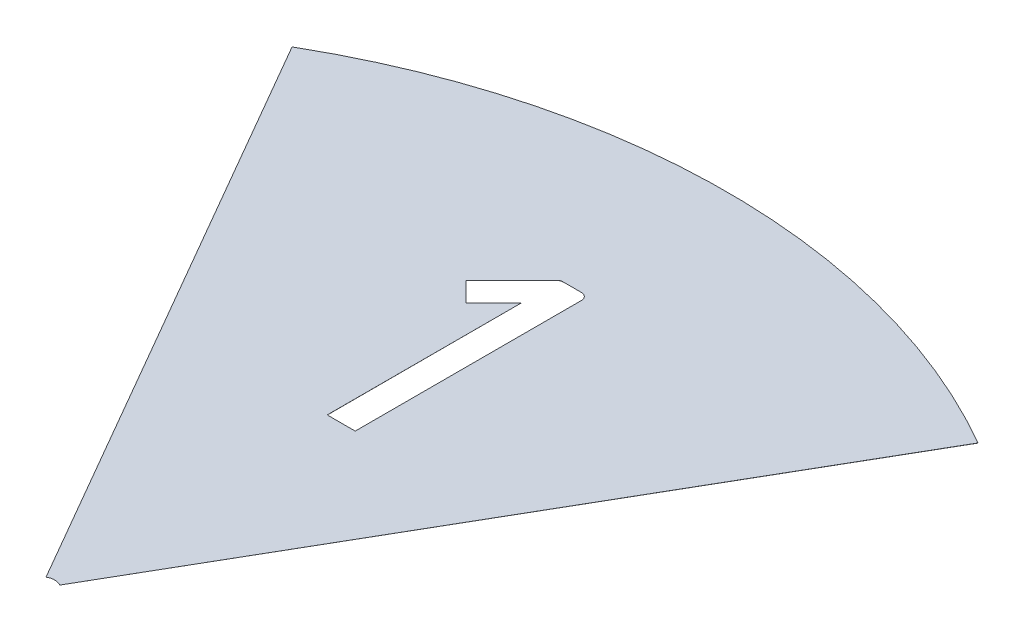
ISO-10303-21;
HEADER;
FILE_DESCRIPTION(('STEP AP214'),'2;1');
FILE_NAME('part.step','',(''),(''),'','','');
FILE_SCHEMA(('AUTOMOTIVE_DESIGN { 1 0 10303 214 1 1 1 1 }'));
ENDSEC;
DATA;
#1=APPLICATION_CONTEXT('core data for automotive mechanical design processes');
#2=APPLICATION_PROTOCOL_DEFINITION('international standard','automotive_design',2000,#1);
#3=PRODUCT_CONTEXT('',#1,'mechanical');
#4=PRODUCT('Part','Part','',(#3));
#5=PRODUCT_RELATED_PRODUCT_CATEGORY('part','',(#4));
#6=PRODUCT_DEFINITION_FORMATION('','',#4);
#7=PRODUCT_DEFINITION_CONTEXT('part definition',#1,'design');
#8=PRODUCT_DEFINITION('design','',#6,#7);
#9=PRODUCT_DEFINITION_SHAPE('','',#8);
#10=(LENGTH_UNIT() NAMED_UNIT(*) SI_UNIT(.MILLI.,.METRE.));
#11=(NAMED_UNIT(*) PLANE_ANGLE_UNIT() SI_UNIT($,.RADIAN.));
#12=(NAMED_UNIT(*) SI_UNIT($,.STERADIAN.) SOLID_ANGLE_UNIT());
#13=UNCERTAINTY_MEASURE_WITH_UNIT(LENGTH_MEASURE(1.E-05),#10,'distance_accuracy_value','');
#14=(GEOMETRIC_REPRESENTATION_CONTEXT(3) GLOBAL_UNCERTAINTY_ASSIGNED_CONTEXT((#13)) GLOBAL_UNIT_ASSIGNED_CONTEXT((#10,
#11,#12)) REPRESENTATION_CONTEXT('',''));
#15=CARTESIAN_POINT('',(0.,0.,0.));
#16=DIRECTION('',(0.,0.,1.));
#17=DIRECTION('',(1.,0.,0.));
#18=AXIS2_PLACEMENT_3D('',#15,#16,#17);
#19=CARTESIAN_POINT('',(-9.51086228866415,-12.7492245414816,13.6871812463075));
#20=DIRECTION('',(0.,1.,0.));
#21=DIRECTION('',(0.,0.,1.));
#22=AXIS2_PLACEMENT_3D('',#19,#20,#21);
#23=PLANE('',#22);
#24=CARTESIAN_POINT('',(-13.4418089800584,-12.7592245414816,-21.2211022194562));
#25=DIRECTION('',(0.707106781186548,0.,0.707106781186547));
#26=VECTOR('',#25,1.);
#27=LINE('',#24,#26);
#28=CARTESIAN_POINT('',(-13.4418088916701,-12.7542245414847,-21.2211023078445));
#29=VERTEX_POINT('',#28);
#30=CARTESIAN_POINT('',(-11.9993112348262,-12.7542245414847,-19.7786044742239));
#31=VERTEX_POINT('',#30);
#32=EDGE_CURVE('E84',#29,#31,#27,.T.);
#33=ORIENTED_EDGE('',*,*,#32,.F.);
#34=CARTESIAN_POINT('',(-10.1472209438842,-12.7592245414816,-24.5156902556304));
#35=DIRECTION('',(-0.707106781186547,0.,0.707106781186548));
#36=VECTOR('',#35,1.);
#37=LINE('',#34,#36);
#38=CARTESIAN_POINT('',(-10.1472209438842,-12.7542245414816,-24.5156902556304));
#39=VERTEX_POINT('',#38);
#40=EDGE_CURVE('E88',#39,#29,#37,.T.);
#41=ORIENTED_EDGE('',*,*,#40,.F.);
#42=CARTESIAN_POINT('',(-9.78659648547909,-12.7492245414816,-24.6650657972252));
#43=CARTESIAN_POINT('',(-9.85412872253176,-12.7492245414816,-24.6581030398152));
#44=CARTESIAN_POINT('',(-9.9891931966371,-12.7492245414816,-24.6441775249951));
#45=CARTESIAN_POINT('',(-10.0945450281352,-12.7492245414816,-24.5585193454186));
#46=CARTESIAN_POINT('',(-10.1472209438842,-12.7492245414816,-24.5156902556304));
#47=B_SPLINE_CURVE_WITH_KNOTS('',3,(#42,#43,#44,#45,#46),.UNSPECIFIED.,.F.,.F.,(4,1,4),(0.,
0.499999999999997,1.),.UNSPECIFIED.);
#48=CARTESIAN_POINT('',(-9.78659615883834,-12.7542245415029,-24.6650657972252));
#49=VERTEX_POINT('',#48);
#50=EDGE_CURVE('E297',#49,#39,#47,.T.);
#51=ORIENTED_EDGE('',*,*,#50,.F.);
#52=CARTESIAN_POINT('',(-8.46784540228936,-12.7592245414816,-24.6650657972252));
#53=DIRECTION('',(-1.,0.,0.));
#54=VECTOR('',#53,1.);
#55=LINE('',#52,#54);
#56=CARTESIAN_POINT('',(-8.46784540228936,-12.7542245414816,-24.6650657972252));
#57=VERTEX_POINT('',#56);
#58=EDGE_CURVE('E146',#57,#49,#55,.T.);
#59=ORIENTED_EDGE('',*,*,#58,.F.);
#60=CARTESIAN_POINT('',(-8.46784540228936,-12.7492245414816,-24.1550657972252));
#61=DIRECTION('',(0.,1.,0.));
#62=DIRECTION('',(0.,0.,1.));
#63=AXIS2_PLACEMENT_3D('',#60,#61,#62);
#64=CIRCLE('',#63,0.510000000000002);
#65=CARTESIAN_POINT('',(-7.95784540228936,-12.7492245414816,-24.1550657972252));
#66=VERTEX_POINT('',#65);
#67=EDGE_CURVE('E224',#66,#57,#64,.T.);
#68=ORIENTED_EDGE('',*,*,#67,.F.);
#69=DIRECTION('',(0.,0.,-1.));
#70=VECTOR('',#69,1.);
#71=CARTESIAN_POINT('',(-7.95784540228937,-12.7492245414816,-7.66506579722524));
#72=LINE('',#71,#70);
#73=CARTESIAN_POINT('',(-7.95784540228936,-12.7492245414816,-7.66506579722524));
#74=VERTEX_POINT('',#73);
#75=EDGE_CURVE('E278',#74,#66,#72,.T.);
#76=ORIENTED_EDGE('',*,*,#75,.F.);
#77=DIRECTION('',(1.,0.,0.));
#78=VECTOR('',#77,1.);
#79=CARTESIAN_POINT('',(-9.99784540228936,-12.7492245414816,-7.66506579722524));
#80=LINE('',#79,#78);
#81=CARTESIAN_POINT('',(-9.99784540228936,-12.7492245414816,-7.66506579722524));
#82=VERTEX_POINT('',#81);
#83=EDGE_CURVE('E287',#82,#74,#80,.T.);
#84=ORIENTED_EDGE('',*,*,#83,.F.);
#85=DIRECTION('',(0.,0.,1.));
#86=VECTOR('',#85,1.);
#87=CARTESIAN_POINT('',(-9.99784540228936,-12.7492245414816,-21.7800701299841));
#88=LINE('',#87,#86);
#89=CARTESIAN_POINT('',(-9.99784552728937,-12.7542245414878,-21.7800700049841));
#90=VERTEX_POINT('',#89);
#91=EDGE_CURVE('E281',#90,#82,#88,.T.);
#92=ORIENTED_EDGE('',*,*,#91,.F.);
#93=CARTESIAN_POINT('',(-11.9993111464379,-12.7592245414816,-19.7786043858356));
#94=DIRECTION('',(0.707106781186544,0.,-0.707106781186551));
#95=VECTOR('',#94,1.);
#96=LINE('',#93,#95);
#97=EDGE_CURVE('E91',#31,#90,#96,.T.);
#98=ORIENTED_EDGE('',*,*,#97,.F.);
#99=EDGE_LOOP('',(#33,#41,#51,#59,#68,#76,#84,#92,#98));
#100=FACE_BOUND('',#99,.T.);
#101=CARTESIAN_POINT('',(-10.0108622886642,-12.7492245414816,12.8211558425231));
#102=CARTESIAN_POINT('',(-9.77586407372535,-12.7492245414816,12.6863717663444));
#103=CARTESIAN_POINT('',(-9.51086228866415,-12.7492245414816,12.6871812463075));
#104=CARTESIAN_POINT('',(-9.24302270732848,-12.7492245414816,12.6879993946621));
#105=CARTESIAN_POINT('',(-9.01086228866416,-12.7492245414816,12.8211558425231));
#106=B_SPLINE_CURVE_WITH_KNOTS('',2,(#101,#102,#103,#104,#105),.UNSPECIFIED.,.F.,.F.,(3,2,3),
(0.,0.5,1.),.UNSPECIFIED.);
#107=CARTESIAN_POINT('',(-10.0108622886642,-12.7542245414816,12.8211558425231));
#108=VERTEX_POINT('',#107);
#109=CARTESIAN_POINT('',(-9.01086228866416,-12.7542245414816,12.8211558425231));
#110=VERTEX_POINT('',#109);
#111=EDGE_CURVE('E26',#108,#110,#106,.T.);
#112=ORIENTED_EDGE('',*,*,#111,.T.);
#113=DIRECTION('',(0.499999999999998,0.,-0.86602540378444));
#114=VECTOR('',#113,1.);
#115=CARTESIAN_POINT('',(-9.01086228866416,-12.7492245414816,12.8211558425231));
#116=LINE('',#115,#114);
#117=CARTESIAN_POINT('',(15.4891377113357,-12.7492245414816,-29.6140889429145));
#118=VERTEX_POINT('',#117);
#119=EDGE_CURVE('E103',#110,#118,#116,.T.);
#120=ORIENTED_EDGE('',*,*,#119,.T.);
#121=CARTESIAN_POINT('',(-9.51086228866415,-12.7492245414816,13.6871812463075));
#122=DIRECTION('',(0.,1.,0.));
#123=DIRECTION('',(0.,0.,1.));
#124=AXIS2_PLACEMENT_3D('',#121,#122,#123);
#125=CIRCLE('',#124,50.);
#126=CARTESIAN_POINT('',(-34.510862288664,-12.7492245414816,-29.6140889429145));
#127=VERTEX_POINT('',#126);
#128=EDGE_CURVE('E219',#118,#127,#125,.T.);
#129=ORIENTED_EDGE('',*,*,#128,.T.);
#130=DIRECTION('',(0.499999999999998,0.,0.86602540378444));
#131=VECTOR('',#130,1.);
#132=CARTESIAN_POINT('',(-10.0108622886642,-12.7492245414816,12.8211558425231));
#133=LINE('',#132,#131);
#134=EDGE_CURVE('E218',#127,#108,#133,.T.);
#135=ORIENTED_EDGE('',*,*,#134,.T.);
#136=EDGE_LOOP('',(#112,#120,#129,#135));
#137=FACE_BOUND('',#136,.T.);
#138=ADVANCED_FACE('F14',(#100,#137),#23,.T.);
#139=CARTESIAN_POINT('',(-9.78659648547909,-22.7492245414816,-24.6650657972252));
#140=CARTESIAN_POINT('',(-9.85412872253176,-22.7492245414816,-24.6581030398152));
#141=CARTESIAN_POINT('',(-9.9891931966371,-22.7492245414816,-24.6441775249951));
#142=CARTESIAN_POINT('',(-10.0945450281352,-22.7492245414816,-24.5585193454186));
#143=CARTESIAN_POINT('',(-10.1472209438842,-22.7492245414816,-24.5156902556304));
#144=B_SPLINE_CURVE_WITH_KNOTS('',3,(#139,#140,#141,#142,#143),.UNSPECIFIED.,.F.,.F.,(4,1,4),
(0.,0.499999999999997,1.),.UNSPECIFIED.);
#145=DIRECTION('',(0.,1.,0.));
#146=VECTOR('',#145,1.);
#147=SURFACE_OF_LINEAR_EXTRUSION('',#144,#146);
#148=ORIENTED_EDGE('',*,*,#50,.T.);
#149=CARTESIAN_POINT('',(-9.78659648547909,-12.7592245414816,-24.6650657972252));
#150=CARTESIAN_POINT('',(-9.85412872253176,-12.7592245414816,-24.6581030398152));
#151=CARTESIAN_POINT('',(-9.9891931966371,-12.7592245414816,-24.6441775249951));
#152=CARTESIAN_POINT('',(-10.0945450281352,-12.7592245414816,-24.5585193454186));
#153=CARTESIAN_POINT('',(-10.1472209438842,-12.7592245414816,-24.5156902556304));
#154=B_SPLINE_CURVE_WITH_KNOTS('',3,(#149,#150,#151,#152,#153),.UNSPECIFIED.,.F.,.F.,(4,1,4),
(0.,0.499999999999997,1.),.UNSPECIFIED.);
#155=EDGE_CURVE('E102',#49,#39,#154,.T.);
#156=ORIENTED_EDGE('',*,*,#155,.F.);
#157=EDGE_LOOP('',(#148,#156));
#158=FACE_BOUND('',#157,.T.);
#159=ADVANCED_FACE('F117',(#158),#147,.F.);
#160=CARTESIAN_POINT('',(-9.99784540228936,-22.7492245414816,-7.66506579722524));
#161=DIRECTION('',(0.,0.,1.));
#162=DIRECTION('',(1.,0.,0.));
#163=AXIS2_PLACEMENT_3D('',#160,#161,#162);
#164=PLANE('',#163);
#165=DIRECTION('',(0.,1.,0.));
#166=VECTOR('',#165,1.);
#167=CARTESIAN_POINT('',(-9.99784540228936,-22.7492245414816,-7.66506579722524));
#168=LINE('',#167,#166);
#169=CARTESIAN_POINT('',(-9.99784540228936,-12.7592245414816,-7.66506596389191));
#170=VERTEX_POINT('',#169);
#171=EDGE_CURVE('E290',#170,#82,#168,.T.);
#172=ORIENTED_EDGE('',*,*,#171,.T.);
#173=ORIENTED_EDGE('',*,*,#83,.T.);
#174=DIRECTION('',(0.,1.,0.));
#175=VECTOR('',#174,1.);
#176=CARTESIAN_POINT('',(-7.95784540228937,-22.7492245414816,-7.66506579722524));
#177=LINE('',#176,#175);
#178=CARTESIAN_POINT('',(-7.95784556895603,-12.7592245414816,-7.66506579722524));
#179=VERTEX_POINT('',#178);
#180=EDGE_CURVE('E289',#179,#74,#177,.T.);
#181=ORIENTED_EDGE('',*,*,#180,.F.);
#182=CARTESIAN_POINT('',(-9.99784540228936,-12.7592245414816,-7.66506579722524));
#183=CARTESIAN_POINT('',(-7.95784540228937,-12.7592245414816,-7.66506579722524));
#184=B_SPLINE_CURVE_WITH_KNOTS('',1,(#182,#183),.UNSPECIFIED.,.F.,.F.,(2,2),(0.,1.),.UNSPECIFIED.);
#185=EDGE_CURVE('E173',#170,#179,#184,.T.);
#186=ORIENTED_EDGE('',*,*,#185,.F.);
#187=EDGE_LOOP('',(#172,#173,#181,#186));
#188=FACE_BOUND('',#187,.T.);
#189=ADVANCED_FACE('F346',(#188),#164,.F.);
#190=CARTESIAN_POINT('',(-9.99784540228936,-22.7492245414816,-21.7800701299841));
#191=DIRECTION('',(-1.,0.,0.));
#192=DIRECTION('',(0.,0.,1.));
#193=AXIS2_PLACEMENT_3D('',#190,#191,#192);
#194=PLANE('',#193);
#195=ORIENTED_EDGE('',*,*,#91,.T.);
#196=ORIENTED_EDGE('',*,*,#171,.F.);
#197=CARTESIAN_POINT('',(-9.99784540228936,-12.7592245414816,-21.7800701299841));
#198=CARTESIAN_POINT('',(-9.99784540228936,-12.7592245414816,-7.66506579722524));
#199=B_SPLINE_CURVE_WITH_KNOTS('',1,(#197,#198),.UNSPECIFIED.,.F.,.F.,(2,2),(0.,1.),.UNSPECIFIED.);
#200=EDGE_CURVE('E183',#90,#170,#199,.T.);
#201=ORIENTED_EDGE('',*,*,#200,.F.);
#202=EDGE_LOOP('',(#195,#196,#201));
#203=FACE_BOUND('',#202,.T.);
#204=ADVANCED_FACE('F348',(#203),#194,.F.);
#205=CARTESIAN_POINT('',(-7.95784540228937,-22.7492245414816,-7.66506579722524));
#206=DIRECTION('',(1.,0.,0.));
#207=DIRECTION('',(0.,0.,-1.));
#208=AXIS2_PLACEMENT_3D('',#205,#206,#207);
#209=PLANE('',#208);
#210=ORIENTED_EDGE('',*,*,#180,.T.);
#211=ORIENTED_EDGE('',*,*,#75,.T.);
#212=DIRECTION('',(0.,1.,0.));
#213=VECTOR('',#212,1.);
#214=CARTESIAN_POINT('',(-7.95784540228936,-22.7492245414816,-24.1550657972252));
#215=LINE('',#214,#213);
#216=CARTESIAN_POINT('',(-7.95784540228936,-12.7592245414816,-24.1550657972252));
#217=VERTEX_POINT('',#216);
#218=EDGE_CURVE('E280',#217,#66,#215,.T.);
#219=ORIENTED_EDGE('',*,*,#218,.F.);
#220=CARTESIAN_POINT('',(-7.95784540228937,-12.7592245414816,-7.66506579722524));
#221=CARTESIAN_POINT('',(-7.95784540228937,-12.7592245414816,-24.1550657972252));
#222=B_SPLINE_CURVE_WITH_KNOTS('',1,(#220,#221),.UNSPECIFIED.,.F.,.F.,(2,2),(0.,1.),.UNSPECIFIED.);
#223=EDGE_CURVE('E159',#179,#217,#222,.T.);
#224=ORIENTED_EDGE('',*,*,#223,.F.);
#225=EDGE_LOOP('',(#210,#211,#219,#224));
#226=FACE_BOUND('',#225,.T.);
#227=ADVANCED_FACE('F343',(#226),#209,.F.);
#228=CARTESIAN_POINT('',(-8.46784540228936,-22.7492245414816,-24.1550657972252));
#229=DIRECTION('',(0.,1.,0.));
#230=DIRECTION('',(0.,0.,1.));
#231=AXIS2_PLACEMENT_3D('',#228,#229,#230);
#232=CYLINDRICAL_SURFACE('',#231,0.510000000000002);
#233=ORIENTED_EDGE('',*,*,#218,.T.);
#234=ORIENTED_EDGE('',*,*,#67,.T.);
#235=CARTESIAN_POINT('',(-7.95784540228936,-12.7592245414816,-24.1550657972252));
#236=CARTESIAN_POINT('',(-7.95801499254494,-12.7592245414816,-24.1970721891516));
#237=CARTESIAN_POINT('',(-7.96404755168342,-12.7592245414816,-24.2343609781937));
#238=CARTESIAN_POINT('',(-7.97343634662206,-12.7592245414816,-24.2923955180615));
#239=CARTESIAN_POINT('',(-7.99365336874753,-12.7592245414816,-24.3427940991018));
#240=CARTESIAN_POINT('',(-8.01377611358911,-12.7592245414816,-24.3929576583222));
#241=CARTESIAN_POINT('',(-8.04097769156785,-12.7592245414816,-24.4341427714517));
#242=CARTESIAN_POINT('',(-8.07140328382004,-12.7592245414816,-24.4802092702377));
#243=CARTESIAN_POINT('',(-8.10722094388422,-12.7592245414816,-24.5156902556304));
#244=CARTESIAN_POINT('',(-8.14644206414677,-12.7592245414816,-24.5545427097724));
#245=CARTESIAN_POINT('',(-8.18876842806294,-12.7592245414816,-24.5819335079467));
#246=CARTESIAN_POINT('',(-8.2341442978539,-12.7592245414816,-24.6112977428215));
#247=CARTESIAN_POINT('',(-8.28011710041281,-12.7592245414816,-24.6292578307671));
#248=CARTESIAN_POINT('',(-8.32843242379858,-12.7592245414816,-24.6481330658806));
#249=CARTESIAN_POINT('',(-8.37504424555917,-12.7592245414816,-24.6565515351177));
#250=CARTESIAN_POINT('',(-8.42114247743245,-12.7592245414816,-24.6648772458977));
#251=CARTESIAN_POINT('',(-8.46784540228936,-12.7592245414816,-24.6650657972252));
#252=B_SPLINE_CURVE_WITH_KNOTS('',2,(#235,#236,#237,#238,#239,#240,#241,#242,#243,#244,#245,
#246,#247,#248,#249,#250,#251),.UNSPECIFIED.,.F.,.F.,(3,2,2,2,2,2,2,2,3),(0.,0.107142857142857,
0.25,0.375,0.5,0.625,0.75,0.875,1.),.UNSPECIFIED.);
#253=EDGE_CURVE('E156',#217,#57,#252,.T.);
#254=ORIENTED_EDGE('',*,*,#253,.F.);
#255=EDGE_LOOP('',(#233,#234,#254));
#256=FACE_BOUND('',#255,.T.);
#257=ADVANCED_FACE('F246',(#256),#232,.F.);
#258=CARTESIAN_POINT('',(-9.51086228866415,-12.7492245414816,13.6871812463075));
#259=DIRECTION('',(0.,-1.,0.));
#260=DIRECTION('',(0.,0.,-1.));
#261=AXIS2_PLACEMENT_3D('',#258,#259,#260);
#262=CYLINDRICAL_SURFACE('',#261,50.);
#263=CARTESIAN_POINT('',(-9.51086228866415,-12.7592245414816,13.6871812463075));
#264=DIRECTION('',(0.,1.,0.));
#265=DIRECTION('',(0.499999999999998,0.,-0.86602540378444));
#266=AXIS2_PLACEMENT_3D('',#263,#264,#265);
#267=CIRCLE('',#266,50.);
#268=CARTESIAN_POINT('',(15.4891377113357,-12.7592245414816,-29.6140889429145));
#269=VERTEX_POINT('',#268);
#270=CARTESIAN_POINT('',(-34.5108622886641,-12.7592245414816,-29.6140889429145));
#271=VERTEX_POINT('',#270);
#272=EDGE_CURVE('E95',#269,#271,#267,.T.);
#273=ORIENTED_EDGE('',*,*,#272,.T.);
#274=DIRECTION('',(0.,-1.,0.));
#275=VECTOR('',#274,1.);
#276=CARTESIAN_POINT('',(-34.510862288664,-12.7492245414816,-29.6140889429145));
#277=LINE('',#276,#275);
#278=EDGE_CURVE('E222',#127,#271,#277,.T.);
#279=ORIENTED_EDGE('',*,*,#278,.F.);
#280=ORIENTED_EDGE('',*,*,#128,.F.);
#281=DIRECTION('',(0.,-1.,0.));
#282=VECTOR('',#281,1.);
#283=CARTESIAN_POINT('',(15.4891377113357,-12.7492245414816,-29.6140889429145));
#284=LINE('',#283,#282);
#285=EDGE_CURVE('E35',#118,#269,#284,.T.);
#286=ORIENTED_EDGE('',*,*,#285,.T.);
#287=EDGE_LOOP('',(#273,#279,#280,#286));
#288=FACE_BOUND('',#287,.T.);
#289=ADVANCED_FACE('F235',(#288),#262,.T.);
#290=CARTESIAN_POINT('',(-10.0108622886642,-12.7492245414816,12.8211558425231));
#291=DIRECTION('',(0.86602540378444,0.,-0.499999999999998));
#292=DIRECTION('',(-0.499999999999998,0.,-0.86602540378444));
#293=AXIS2_PLACEMENT_3D('',#290,#291,#292);
#294=PLANE('',#293);
#295=CARTESIAN_POINT('',(-34.5108622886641,-12.7592245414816,-29.6140889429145));
#296=CARTESIAN_POINT('',(-10.0108622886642,-12.7592245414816,12.8211558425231));
#297=B_SPLINE_CURVE_WITH_KNOTS('',1,(#295,#296),.UNSPECIFIED.,.F.,.F.,(2,2),(0.,1.),.UNSPECIFIED.);
#298=EDGE_CURVE('E197',#271,#108,#297,.T.);
#299=ORIENTED_EDGE('',*,*,#298,.T.);
#300=ORIENTED_EDGE('',*,*,#134,.F.);
#301=ORIENTED_EDGE('',*,*,#278,.T.);
#302=EDGE_LOOP('',(#299,#300,#301));
#303=FACE_BOUND('',#302,.T.);
#304=ADVANCED_FACE('F245',(#303),#294,.F.);
#305=CARTESIAN_POINT('',(-9.01086228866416,-12.7492245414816,12.8211558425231));
#306=DIRECTION('',(-0.86602540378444,0.,-0.499999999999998));
#307=DIRECTION('',(-0.499999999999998,0.,0.86602540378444));
#308=AXIS2_PLACEMENT_3D('',#305,#306,#307);
#309=PLANE('',#308);
#310=CARTESIAN_POINT('',(-9.01086228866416,-12.7592245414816,12.8211558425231));
#311=CARTESIAN_POINT('',(15.4891377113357,-12.7592245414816,-29.6140889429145));
#312=B_SPLINE_CURVE_WITH_KNOTS('',1,(#310,#311),.UNSPECIFIED.,.F.,.F.,(2,2),(0.,1.),.UNSPECIFIED.);
#313=EDGE_CURVE('E9',#110,#269,#312,.T.);
#314=ORIENTED_EDGE('',*,*,#313,.T.);
#315=ORIENTED_EDGE('',*,*,#285,.F.);
#316=ORIENTED_EDGE('',*,*,#119,.F.);
#317=EDGE_LOOP('',(#314,#315,#316));
#318=FACE_BOUND('',#317,.T.);
#319=ADVANCED_FACE('F250',(#318),#309,.F.);
#320=CARTESIAN_POINT('',(-9.51086228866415,-12.7592245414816,13.6871812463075));
#321=DIRECTION('',(0.,1.,0.));
#322=DIRECTION('',(0.,0.,1.));
#323=AXIS2_PLACEMENT_3D('',#320,#321,#322);
#324=PLANE('',#323);
#325=ORIENTED_EDGE('',*,*,#40,.T.);
#326=ORIENTED_EDGE('',*,*,#32,.T.);
#327=ORIENTED_EDGE('',*,*,#97,.T.);
#328=ORIENTED_EDGE('',*,*,#200,.T.);
#329=ORIENTED_EDGE('',*,*,#185,.T.);
#330=ORIENTED_EDGE('',*,*,#223,.T.);
#331=ORIENTED_EDGE('',*,*,#253,.T.);
#332=ORIENTED_EDGE('',*,*,#58,.T.);
#333=ORIENTED_EDGE('',*,*,#155,.T.);
#334=EDGE_LOOP('',(#325,#326,#327,#328,#329,#330,#331,#332,#333));
#335=FACE_BOUND('',#334,.T.);
#336=ORIENTED_EDGE('',*,*,#272,.F.);
#337=ORIENTED_EDGE('',*,*,#313,.F.);
#338=ORIENTED_EDGE('',*,*,#111,.F.);
#339=ORIENTED_EDGE('',*,*,#298,.F.);
#340=EDGE_LOOP('',(#336,#337,#338,#339));
#341=FACE_BOUND('',#340,.T.);
#342=ADVANCED_FACE('F16',(#335,#341),#324,.F.);
#343=CLOSED_SHELL('',(#138,#159,#189,#204,#227,#257,#289,#304,#319,#342));
#344=MANIFOLD_SOLID_BREP('B1',#343);
#345=ADVANCED_BREP_SHAPE_REPRESENTATION('',(#18,#344),#14);
#346=SHAPE_DEFINITION_REPRESENTATION(#9,#345);
ENDSEC;
END-ISO-10303-21;
